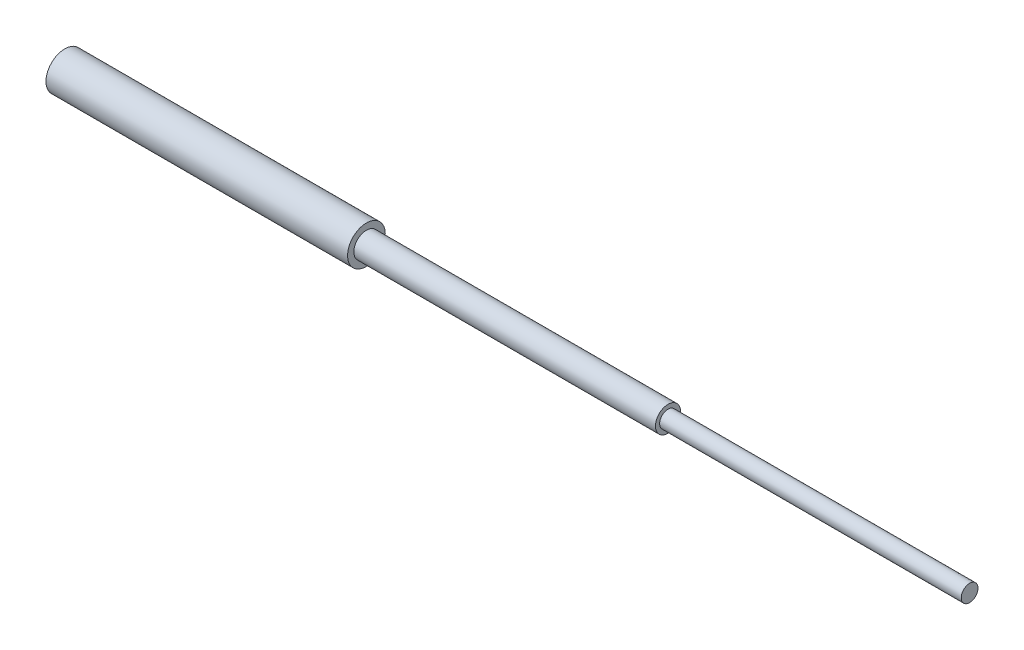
ISO-10303-21;
HEADER;
FILE_DESCRIPTION(('STEP AP214'),'2;1');
FILE_NAME('part.step','',(''),(''),'','','');
FILE_SCHEMA(('AUTOMOTIVE_DESIGN { 1 0 10303 214 1 1 1 1 }'));
ENDSEC;
DATA;
#1=APPLICATION_CONTEXT('core data for automotive mechanical design processes');
#2=APPLICATION_PROTOCOL_DEFINITION('international standard','automotive_design',2000,#1);
#3=PRODUCT_CONTEXT('',#1,'mechanical');
#4=PRODUCT('Part','Part','',(#3));
#5=PRODUCT_RELATED_PRODUCT_CATEGORY('part','',(#4));
#6=PRODUCT_DEFINITION_FORMATION('','',#4);
#7=PRODUCT_DEFINITION_CONTEXT('part definition',#1,'design');
#8=PRODUCT_DEFINITION('design','',#6,#7);
#9=PRODUCT_DEFINITION_SHAPE('','',#8);
#10=(LENGTH_UNIT() NAMED_UNIT(*) SI_UNIT(.MILLI.,.METRE.));
#11=(NAMED_UNIT(*) PLANE_ANGLE_UNIT() SI_UNIT($,.RADIAN.));
#12=(NAMED_UNIT(*) SI_UNIT($,.STERADIAN.) SOLID_ANGLE_UNIT());
#13=UNCERTAINTY_MEASURE_WITH_UNIT(LENGTH_MEASURE(1.E-05),#10,'distance_accuracy_value','');
#14=(GEOMETRIC_REPRESENTATION_CONTEXT(3) GLOBAL_UNCERTAINTY_ASSIGNED_CONTEXT((#13)) GLOBAL_UNIT_ASSIGNED_CONTEXT((#10,
#11,#12)) REPRESENTATION_CONTEXT('',''));
#15=CARTESIAN_POINT('',(0.,0.,0.));
#16=DIRECTION('',(0.,0.,1.));
#17=DIRECTION('',(1.,0.,0.));
#18=AXIS2_PLACEMENT_3D('',#15,#16,#17);
#19=CARTESIAN_POINT('',(914.4,0.,0.));
#20=DIRECTION('',(1.,0.,0.));
#21=DIRECTION('',(0.,0.,-1.));
#22=AXIS2_PLACEMENT_3D('',#19,#20,#21);
#23=PLANE('',#22);
#24=CARTESIAN_POINT('',(914.4,0.,0.));
#25=DIRECTION('',(1.,0.,0.));
#26=DIRECTION('',(0.,0.,-1.));
#27=AXIS2_PLACEMENT_3D('',#24,#25,#26);
#28=CIRCLE('',#27,19.05);
#29=CARTESIAN_POINT('',(914.4,0.,-19.05));
#30=VERTEX_POINT('',#29);
#31=EDGE_CURVE('E41',#30,#30,#28,.T.);
#32=ORIENTED_EDGE('',*,*,#31,.T.);
#33=EDGE_LOOP('',(#32));
#34=FACE_BOUND('',#33,.T.);
#35=CARTESIAN_POINT('',(914.4,0.,0.));
#36=DIRECTION('',(1.,0.,0.));
#37=DIRECTION('',(0.,0.,-1.));
#38=AXIS2_PLACEMENT_3D('',#35,#36,#37);
#39=CIRCLE('',#38,12.7);
#40=CARTESIAN_POINT('',(914.4,0.,-12.7));
#41=VERTEX_POINT('',#40);
#42=EDGE_CURVE('E53',#41,#41,#39,.T.);
#43=ORIENTED_EDGE('',*,*,#42,.F.);
#44=EDGE_LOOP('',(#43));
#45=FACE_BOUND('',#44,.T.);
#46=ADVANCED_FACE('F30',(#34,#45),#23,.T.);
#47=CARTESIAN_POINT('',(457.2,0.,0.));
#48=DIRECTION('',(1.,0.,0.));
#49=DIRECTION('',(0.,0.,-1.));
#50=AXIS2_PLACEMENT_3D('',#47,#48,#49);
#51=PLANE('',#50);
#52=CARTESIAN_POINT('',(457.2,0.,0.));
#53=DIRECTION('',(1.,0.,0.));
#54=DIRECTION('',(0.,0.,-1.));
#55=AXIS2_PLACEMENT_3D('',#52,#53,#54);
#56=CIRCLE('',#55,28.575);
#57=CARTESIAN_POINT('',(457.2,0.,-28.575));
#58=VERTEX_POINT('',#57);
#59=EDGE_CURVE('E10',#58,#58,#56,.T.);
#60=ORIENTED_EDGE('',*,*,#59,.T.);
#61=EDGE_LOOP('',(#60));
#62=FACE_BOUND('',#61,.T.);
#63=CARTESIAN_POINT('',(457.2,0.,0.));
#64=DIRECTION('',(1.,0.,0.));
#65=DIRECTION('',(0.,0.,-1.));
#66=AXIS2_PLACEMENT_3D('',#63,#64,#65);
#67=CIRCLE('',#66,19.05);
#68=CARTESIAN_POINT('',(457.2,0.,-19.05));
#69=VERTEX_POINT('',#68);
#70=EDGE_CURVE('E45',#69,#69,#67,.T.);
#71=ORIENTED_EDGE('',*,*,#70,.F.);
#72=EDGE_LOOP('',(#71));
#73=FACE_BOUND('',#72,.T.);
#74=ADVANCED_FACE('F60',(#62,#73),#51,.T.);
#75=CARTESIAN_POINT('',(457.2,0.,0.));
#76=DIRECTION('',(-1.,0.,0.));
#77=DIRECTION('',(0.,0.,1.));
#78=AXIS2_PLACEMENT_3D('',#75,#76,#77);
#79=CYLINDRICAL_SURFACE('',#78,28.575);
#80=ORIENTED_EDGE('',*,*,#59,.F.);
#81=EDGE_LOOP('',(#80));
#82=FACE_BOUND('',#81,.T.);
#83=CARTESIAN_POINT('',(0.,0.,0.));
#84=DIRECTION('',(1.,0.,0.));
#85=DIRECTION('',(0.,0.,-1.));
#86=AXIS2_PLACEMENT_3D('',#83,#84,#85);
#87=CIRCLE('',#86,28.575);
#88=CARTESIAN_POINT('',(0.,0.,-28.575));
#89=VERTEX_POINT('',#88);
#90=EDGE_CURVE('E37',#89,#89,#87,.T.);
#91=ORIENTED_EDGE('',*,*,#90,.T.);
#92=EDGE_LOOP('',(#91));
#93=FACE_BOUND('',#92,.T.);
#94=ADVANCED_FACE('F32',(#82,#93),#79,.T.);
#95=CARTESIAN_POINT('',(0.,0.,0.));
#96=DIRECTION('',(1.,0.,0.));
#97=DIRECTION('',(0.,0.,-1.));
#98=AXIS2_PLACEMENT_3D('',#95,#96,#97);
#99=PLANE('',#98);
#100=ORIENTED_EDGE('',*,*,#90,.F.);
#101=EDGE_LOOP('',(#100));
#102=FACE_BOUND('',#101,.T.);
#103=ADVANCED_FACE('F72',(#102),#99,.F.);
#104=CARTESIAN_POINT('',(914.4,0.,0.));
#105=DIRECTION('',(-1.,0.,0.));
#106=DIRECTION('',(0.,0.,1.));
#107=AXIS2_PLACEMENT_3D('',#104,#105,#106);
#108=CYLINDRICAL_SURFACE('',#107,19.05);
#109=ORIENTED_EDGE('',*,*,#31,.F.);
#110=EDGE_LOOP('',(#109));
#111=FACE_BOUND('',#110,.T.);
#112=ORIENTED_EDGE('',*,*,#70,.T.);
#113=EDGE_LOOP('',(#112));
#114=FACE_BOUND('',#113,.T.);
#115=ADVANCED_FACE('F69',(#111,#114),#108,.T.);
#116=CARTESIAN_POINT('',(1371.6,0.,0.));
#117=DIRECTION('',(-1.,0.,0.));
#118=DIRECTION('',(0.,0.,1.));
#119=AXIS2_PLACEMENT_3D('',#116,#117,#118);
#120=CYLINDRICAL_SURFACE('',#119,12.7);
#121=CARTESIAN_POINT('',(1371.6,0.,0.));
#122=DIRECTION('',(1.,0.,0.));
#123=DIRECTION('',(0.,0.,-1.));
#124=AXIS2_PLACEMENT_3D('',#121,#122,#123);
#125=CIRCLE('',#124,12.7);
#126=CARTESIAN_POINT('',(1371.6,0.,-12.7));
#127=VERTEX_POINT('',#126);
#128=EDGE_CURVE('E50',#127,#127,#125,.T.);
#129=ORIENTED_EDGE('',*,*,#128,.F.);
#130=EDGE_LOOP('',(#129));
#131=FACE_BOUND('',#130,.T.);
#132=ORIENTED_EDGE('',*,*,#42,.T.);
#133=EDGE_LOOP('',(#132));
#134=FACE_BOUND('',#133,.T.);
#135=ADVANCED_FACE('F57',(#131,#134),#120,.T.);
#136=CARTESIAN_POINT('',(1371.6,0.,0.));
#137=DIRECTION('',(1.,0.,0.));
#138=DIRECTION('',(0.,0.,-1.));
#139=AXIS2_PLACEMENT_3D('',#136,#137,#138);
#140=PLANE('',#139);
#141=ORIENTED_EDGE('',*,*,#128,.T.);
#142=EDGE_LOOP('',(#141));
#143=FACE_BOUND('',#142,.T.);
#144=ADVANCED_FACE('F107',(#143),#140,.T.);
#145=CLOSED_SHELL('',(#46,#74,#94,#103,#115,#135,#144));
#146=MANIFOLD_SOLID_BREP('B2',#145);
#147=ADVANCED_BREP_SHAPE_REPRESENTATION('',(#18,#146),#14);
#148=SHAPE_DEFINITION_REPRESENTATION(#9,#147);
ENDSEC;
END-ISO-10303-21;
